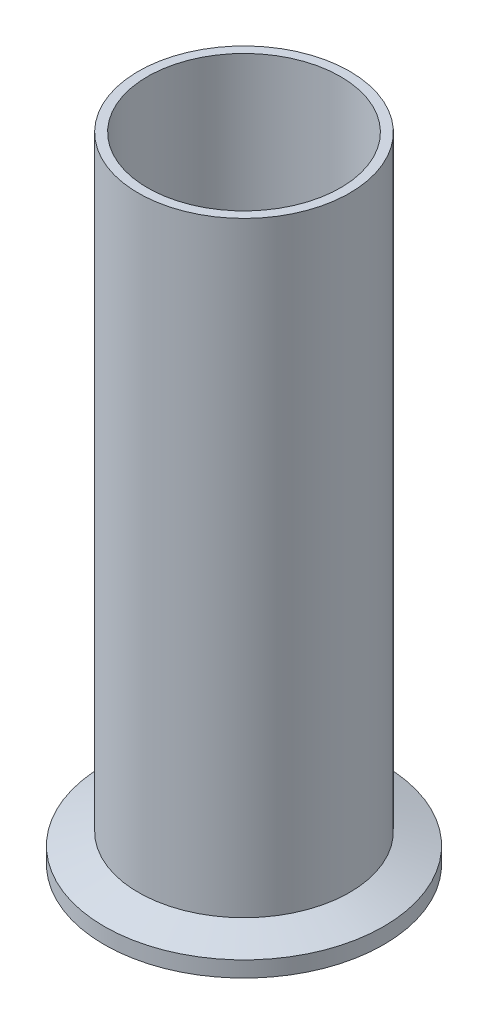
ISO-10303-21;
HEADER;
FILE_DESCRIPTION(('STEP AP214'),'2;1');
FILE_NAME('part.step','',(''),(''),'','','');
FILE_SCHEMA(('AUTOMOTIVE_DESIGN { 1 0 10303 214 1 1 1 1 }'));
ENDSEC;
DATA;
#1=APPLICATION_CONTEXT('core data for automotive mechanical design processes');
#2=APPLICATION_PROTOCOL_DEFINITION('international standard','automotive_design',2000,#1);
#3=PRODUCT_CONTEXT('',#1,'mechanical');
#4=PRODUCT('Part','Part','',(#3));
#5=PRODUCT_RELATED_PRODUCT_CATEGORY('part','',(#4));
#6=PRODUCT_DEFINITION_FORMATION('','',#4);
#7=PRODUCT_DEFINITION_CONTEXT('part definition',#1,'design');
#8=PRODUCT_DEFINITION('design','',#6,#7);
#9=PRODUCT_DEFINITION_SHAPE('','',#8);
#10=(LENGTH_UNIT() NAMED_UNIT(*) SI_UNIT(.MILLI.,.METRE.));
#11=(NAMED_UNIT(*) PLANE_ANGLE_UNIT() SI_UNIT($,.RADIAN.));
#12=(NAMED_UNIT(*) SI_UNIT($,.STERADIAN.) SOLID_ANGLE_UNIT());
#13=UNCERTAINTY_MEASURE_WITH_UNIT(LENGTH_MEASURE(1.E-05),#10,'distance_accuracy_value','');
#14=(GEOMETRIC_REPRESENTATION_CONTEXT(3) GLOBAL_UNCERTAINTY_ASSIGNED_CONTEXT((#13)) GLOBAL_UNIT_ASSIGNED_CONTEXT((#10,
#11,#12)) REPRESENTATION_CONTEXT('',''));
#15=CARTESIAN_POINT('',(0.,0.,0.));
#16=DIRECTION('',(0.,0.,1.));
#17=DIRECTION('',(1.,0.,0.));
#18=AXIS2_PLACEMENT_3D('',#15,#16,#17);
#19=CARTESIAN_POINT('',(0.,0.7874,0.));
#20=DIRECTION('',(0.,-1.,0.));
#21=DIRECTION('',(0.,0.,-1.));
#22=AXIS2_PLACEMENT_3D('',#19,#20,#21);
#23=TOROIDAL_SURFACE('',#22,23.6366084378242,0.787399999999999);
#24=CARTESIAN_POINT('',(0.,0.,0.));
#25=DIRECTION('',(0.,-1.,0.));
#26=DIRECTION('',(0.,0.,-1.));
#27=AXIS2_PLACEMENT_3D('',#24,#25,#26);
#28=CIRCLE('',#27,23.6366084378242);
#29=CARTESIAN_POINT('',(0.,0.,-23.6366084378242));
#30=VERTEX_POINT('',#29);
#31=EDGE_CURVE('E67',#30,#30,#28,.T.);
#32=ORIENTED_EDGE('',*,*,#31,.T.);
#33=EDGE_LOOP('',(#32));
#34=FACE_BOUND('',#33,.T.);
#35=CARTESIAN_POINT('',(0.,0.474458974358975,0.));
#36=DIRECTION('',(0.,-1.,0.));
#37=DIRECTION('',(0.,0.,-1.));
#38=AXIS2_PLACEMENT_3D('',#35,#36,#37);
#39=CIRCLE('',#38,22.9140666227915);
#40=CARTESIAN_POINT('',(0.,0.474458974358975,-22.9140666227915));
#41=VERTEX_POINT('',#40);
#42=EDGE_CURVE('E10',#41,#41,#39,.T.);
#43=ORIENTED_EDGE('',*,*,#42,.F.);
#44=EDGE_LOOP('',(#43));
#45=FACE_BOUND('',#44,.T.);
#46=ADVANCED_FACE('F33',(#34,#45),#23,.T.);
#47=CARTESIAN_POINT('',(0.,0.,0.));
#48=DIRECTION('',(0.,-1.,0.));
#49=DIRECTION('',(0.,0.,-1.));
#50=AXIS2_PLACEMENT_3D('',#47,#48,#49);
#51=TOROIDAL_SURFACE('',#50,21.8186,1.1938);
#52=CARTESIAN_POINT('',(0.,0.474458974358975,0.));
#53=DIRECTION('',(0.,-1.,0.));
#54=DIRECTION('',(0.,0.,-1.));
#55=AXIS2_PLACEMENT_3D('',#52,#53,#54);
#56=CIRCLE('',#55,20.7231333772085);
#57=CARTESIAN_POINT('',(0.,0.474458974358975,-20.7231333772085));
#58=VERTEX_POINT('',#57);
#59=EDGE_CURVE('E39',#58,#58,#56,.T.);
#60=ORIENTED_EDGE('',*,*,#59,.F.);
#61=EDGE_LOOP('',(#60));
#62=FACE_BOUND('',#61,.T.);
#63=ORIENTED_EDGE('',*,*,#42,.T.);
#64=EDGE_LOOP('',(#63));
#65=FACE_BOUND('',#64,.T.);
#66=ADVANCED_FACE('F115',(#62,#65),#51,.F.);
#67=CARTESIAN_POINT('',(0.,0.787400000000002,0.));
#68=DIRECTION('',(0.,-1.,0.));
#69=DIRECTION('',(0.,0.,-1.));
#70=AXIS2_PLACEMENT_3D('',#67,#68,#69);
#71=TOROIDAL_SURFACE('',#70,20.0005915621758,0.787399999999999);
#72=ORIENTED_EDGE('',*,*,#59,.T.);
#73=EDGE_LOOP('',(#72));
#74=FACE_BOUND('',#73,.T.);
#75=CARTESIAN_POINT('',(0.,0.,0.));
#76=DIRECTION('',(0.,-1.,0.));
#77=DIRECTION('',(0.,0.,-1.));
#78=AXIS2_PLACEMENT_3D('',#75,#76,#77);
#79=CIRCLE('',#78,20.0005915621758);
#80=CARTESIAN_POINT('',(0.,0.,-20.0005915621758));
#81=VERTEX_POINT('',#80);
#82=EDGE_CURVE('E43',#81,#81,#79,.T.);
#83=ORIENTED_EDGE('',*,*,#82,.F.);
#84=EDGE_LOOP('',(#83));
#85=FACE_BOUND('',#84,.T.);
#86=ADVANCED_FACE('F111',(#74,#85),#71,.T.);
#87=CARTESIAN_POINT('',(0.,0.,0.));
#88=DIRECTION('',(0.,1.,0.));
#89=DIRECTION('',(0.,0.,1.));
#90=AXIS2_PLACEMENT_3D('',#87,#88,#89);
#91=PLANE('',#90);
#92=CARTESIAN_POINT('',(0.,0.,0.));
#93=DIRECTION('',(0.,-1.,0.));
#94=DIRECTION('',(0.,0.,-1.));
#95=AXIS2_PLACEMENT_3D('',#92,#93,#94);
#96=CIRCLE('',#95,17.399);
#97=CARTESIAN_POINT('',(0.,0.,-17.399));
#98=VERTEX_POINT('',#97);
#99=EDGE_CURVE('E47',#98,#98,#96,.T.);
#100=ORIENTED_EDGE('',*,*,#99,.F.);
#101=EDGE_LOOP('',(#100));
#102=FACE_BOUND('',#101,.T.);
#103=ORIENTED_EDGE('',*,*,#82,.T.);
#104=EDGE_LOOP('',(#103));
#105=FACE_BOUND('',#104,.T.);
#106=ADVANCED_FACE('F105',(#102,#105),#91,.F.);
#107=CARTESIAN_POINT('',(0.,0.,0.));
#108=DIRECTION('',(0.,-1.,0.));
#109=DIRECTION('',(0.,0.,-1.));
#110=AXIS2_PLACEMENT_3D('',#107,#108,#109);
#111=CYLINDRICAL_SURFACE('',#110,17.399);
#112=ORIENTED_EDGE('',*,*,#99,.T.);
#113=EDGE_LOOP('',(#112));
#114=FACE_BOUND('',#113,.T.);
#115=CARTESIAN_POINT('',(0.,114.3,0.));
#116=DIRECTION('',(0.,-1.,0.));
#117=DIRECTION('',(0.,0.,-1.));
#118=AXIS2_PLACEMENT_3D('',#115,#116,#117);
#119=CIRCLE('',#118,17.399);
#120=CARTESIAN_POINT('',(0.,114.3,-17.399));
#121=VERTEX_POINT('',#120);
#122=EDGE_CURVE('E52',#121,#121,#119,.T.);
#123=ORIENTED_EDGE('',*,*,#122,.F.);
#124=EDGE_LOOP('',(#123));
#125=FACE_BOUND('',#124,.T.);
#126=ADVANCED_FACE('F100',(#114,#125),#111,.F.);
#127=CARTESIAN_POINT('',(0.,114.3,0.));
#128=DIRECTION('',(0.,-1.,0.));
#129=DIRECTION('',(0.,0.,-1.));
#130=AXIS2_PLACEMENT_3D('',#127,#128,#129);
#131=PLANE('',#130);
#132=CARTESIAN_POINT('',(0.,114.3,0.));
#133=DIRECTION('',(0.,-1.,0.));
#134=DIRECTION('',(0.,0.,-1.));
#135=AXIS2_PLACEMENT_3D('',#132,#133,#134);
#136=CIRCLE('',#135,19.05);
#137=CARTESIAN_POINT('',(0.,114.3,-19.05));
#138=VERTEX_POINT('',#137);
#139=EDGE_CURVE('E55',#138,#138,#136,.T.);
#140=ORIENTED_EDGE('',*,*,#139,.F.);
#141=EDGE_LOOP('',(#140));
#142=FACE_BOUND('',#141,.T.);
#143=ORIENTED_EDGE('',*,*,#122,.T.);
#144=EDGE_LOOP('',(#143));
#145=FACE_BOUND('',#144,.T.);
#146=ADVANCED_FACE('F94',(#142,#145),#131,.F.);
#147=CARTESIAN_POINT('',(0.,0.,0.));
#148=DIRECTION('',(0.,-1.,0.));
#149=DIRECTION('',(0.,0.,-1.));
#150=AXIS2_PLACEMENT_3D('',#147,#148,#149);
#151=CYLINDRICAL_SURFACE('',#150,19.05);
#152=CARTESIAN_POINT('',(0.,5.08205223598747,0.));
#153=DIRECTION('',(0.,-1.,0.));
#154=DIRECTION('',(0.,0.,-1.));
#155=AXIS2_PLACEMENT_3D('',#152,#153,#154);
#156=CIRCLE('',#155,19.05);
#157=CARTESIAN_POINT('',(0.,5.08205223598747,-19.05));
#158=VERTEX_POINT('',#157);
#159=EDGE_CURVE('E58',#158,#158,#156,.T.);
#160=ORIENTED_EDGE('',*,*,#159,.F.);
#161=EDGE_LOOP('',(#160));
#162=FACE_BOUND('',#161,.T.);
#163=ORIENTED_EDGE('',*,*,#139,.T.);
#164=EDGE_LOOP('',(#163));
#165=FACE_BOUND('',#164,.T.);
#166=ADVANCED_FACE('F88',(#162,#165),#151,.T.);
#167=CARTESIAN_POINT('',(0.,5.08205223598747,0.));
#168=DIRECTION('',(0.,-1.,0.));
#169=DIRECTION('',(0.,0.,-1.));
#170=AXIS2_PLACEMENT_3D('',#167,#168,#169);
#171=CONICAL_SURFACE('',#170,19.05,1.22173047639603);
#172=CARTESIAN_POINT('',(0.,2.8448,0.));
#173=DIRECTION('',(0.,-1.,0.));
#174=DIRECTION('',(0.,0.,-1.));
#175=AXIS2_PLACEMENT_3D('',#172,#173,#174);
#176=CIRCLE('',#175,25.1968);
#177=CARTESIAN_POINT('',(0.,2.8448,-25.1968));
#178=VERTEX_POINT('',#177);
#179=EDGE_CURVE('E61',#178,#178,#176,.T.);
#180=ORIENTED_EDGE('',*,*,#179,.F.);
#181=EDGE_LOOP('',(#180));
#182=FACE_BOUND('',#181,.T.);
#183=ORIENTED_EDGE('',*,*,#159,.T.);
#184=EDGE_LOOP('',(#183));
#185=FACE_BOUND('',#184,.T.);
#186=ADVANCED_FACE('F82',(#182,#185),#171,.T.);
#187=CARTESIAN_POINT('',(0.,0.,0.));
#188=DIRECTION('',(0.,-1.,0.));
#189=DIRECTION('',(0.,0.,-1.));
#190=AXIS2_PLACEMENT_3D('',#187,#188,#189);
#191=CYLINDRICAL_SURFACE('',#190,25.1968);
#192=CARTESIAN_POINT('',(0.,0.,0.));
#193=DIRECTION('',(0.,-1.,0.));
#194=DIRECTION('',(0.,0.,-1.));
#195=AXIS2_PLACEMENT_3D('',#192,#193,#194);
#196=CIRCLE('',#195,25.1968);
#197=CARTESIAN_POINT('',(0.,0.,-25.1968));
#198=VERTEX_POINT('',#197);
#199=EDGE_CURVE('E64',#198,#198,#196,.T.);
#200=ORIENTED_EDGE('',*,*,#199,.F.);
#201=EDGE_LOOP('',(#200));
#202=FACE_BOUND('',#201,.T.);
#203=ORIENTED_EDGE('',*,*,#179,.T.);
#204=EDGE_LOOP('',(#203));
#205=FACE_BOUND('',#204,.T.);
#206=ADVANCED_FACE('F76',(#202,#205),#191,.T.);
#207=CARTESIAN_POINT('',(0.,0.,0.));
#208=DIRECTION('',(0.,1.,0.));
#209=DIRECTION('',(0.,0.,1.));
#210=AXIS2_PLACEMENT_3D('',#207,#208,#209);
#211=PLANE('',#210);
#212=ORIENTED_EDGE('',*,*,#31,.F.);
#213=EDGE_LOOP('',(#212));
#214=FACE_BOUND('',#213,.T.);
#215=ORIENTED_EDGE('',*,*,#199,.T.);
#216=EDGE_LOOP('',(#215));
#217=FACE_BOUND('',#216,.T.);
#218=ADVANCED_FACE('F73',(#214,#217),#211,.F.);
#219=CLOSED_SHELL('',(#46,#66,#86,#106,#126,#146,#166,#186,#206,#218));
#220=MANIFOLD_SOLID_BREP('B2',#219);
#221=ADVANCED_BREP_SHAPE_REPRESENTATION('',(#18,#220),#14);
#222=SHAPE_DEFINITION_REPRESENTATION(#9,#221);
ENDSEC;
END-ISO-10303-21;
